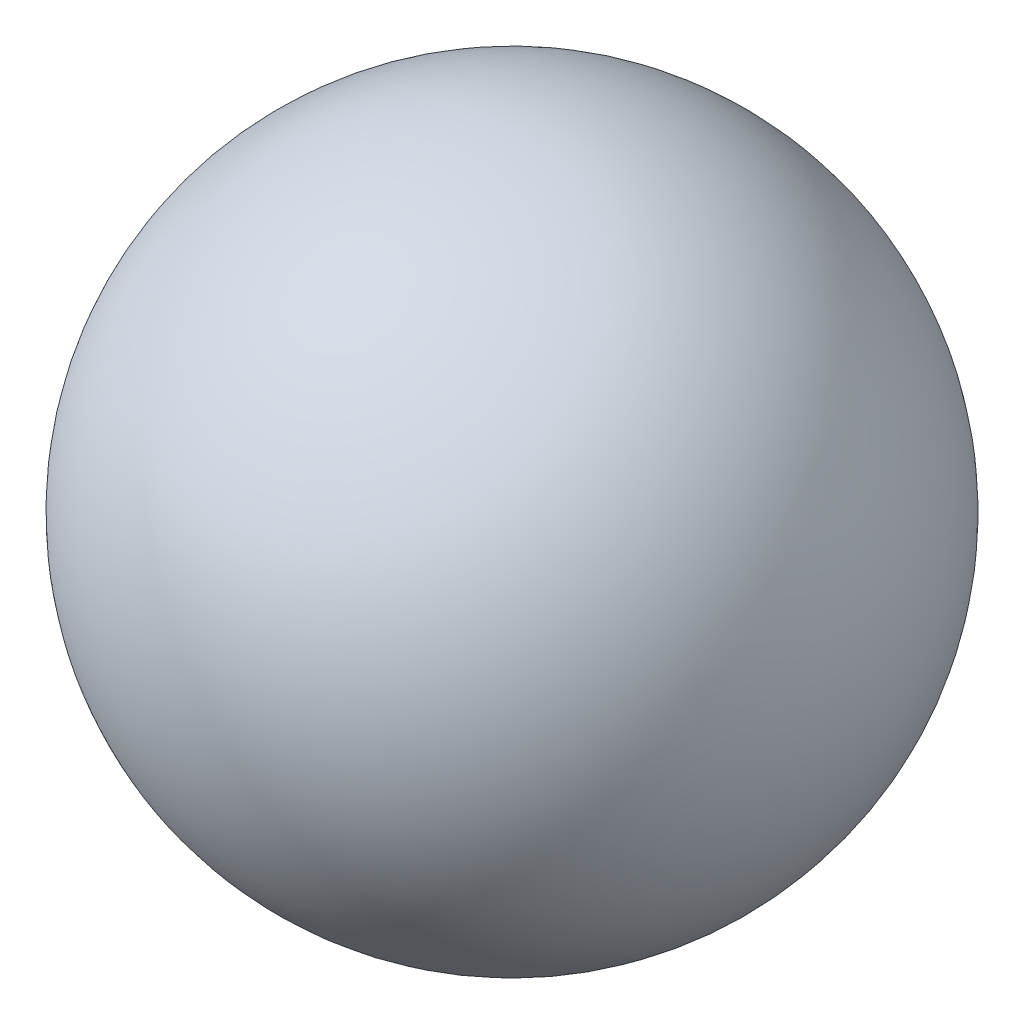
ISO-10303-21;
HEADER;
FILE_DESCRIPTION(('STEP AP214'),'2;1');
FILE_NAME('part.step','',(''),(''),'','','');
FILE_SCHEMA(('AUTOMOTIVE_DESIGN { 1 0 10303 214 1 1 1 1 }'));
ENDSEC;
DATA;
#1=APPLICATION_CONTEXT('core data for automotive mechanical design processes');
#2=APPLICATION_PROTOCOL_DEFINITION('international standard','automotive_design',2000,#1);
#3=PRODUCT_CONTEXT('',#1,'mechanical');
#4=PRODUCT('Part','Part','',(#3));
#5=PRODUCT_RELATED_PRODUCT_CATEGORY('part','',(#4));
#6=PRODUCT_DEFINITION_FORMATION('','',#4);
#7=PRODUCT_DEFINITION_CONTEXT('part definition',#1,'design');
#8=PRODUCT_DEFINITION('design','',#6,#7);
#9=PRODUCT_DEFINITION_SHAPE('','',#8);
#10=(LENGTH_UNIT() NAMED_UNIT(*) SI_UNIT(.MILLI.,.METRE.));
#11=(NAMED_UNIT(*) PLANE_ANGLE_UNIT() SI_UNIT($,.RADIAN.));
#12=(NAMED_UNIT(*) SI_UNIT($,.STERADIAN.) SOLID_ANGLE_UNIT());
#13=UNCERTAINTY_MEASURE_WITH_UNIT(LENGTH_MEASURE(1.E-05),#10,'distance_accuracy_value','');
#14=(GEOMETRIC_REPRESENTATION_CONTEXT(3) GLOBAL_UNCERTAINTY_ASSIGNED_CONTEXT((#13)) GLOBAL_UNIT_ASSIGNED_CONTEXT((#10,
#11,#12)) REPRESENTATION_CONTEXT('',''));
#15=CARTESIAN_POINT('',(0.,0.,0.));
#16=DIRECTION('',(0.,0.,1.));
#17=DIRECTION('',(1.,0.,0.));
#18=AXIS2_PLACEMENT_3D('',#15,#16,#17);
#19=CARTESIAN_POINT('',(0.,0.,8.));
#20=DIRECTION('',(0.,0.,1.));
#21=DIRECTION('',(-1.,0.,0.));
#22=AXIS2_PLACEMENT_3D('',#19,#20,#21);
#23=SPHERICAL_SURFACE('',#22,10.);
#24=CARTESIAN_POINT('',(-9.58979308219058E-08,0.,18.));
#25=VERTEX_POINT('',#24);
#26=VERTEX_LOOP('',#25);
#27=FACE_BOUND('',#26,.T.);
#28=CARTESIAN_POINT('',(0.,0.,0.));
#29=DIRECTION('',(0.,0.,1.));
#30=DIRECTION('',(0.,-1.,0.));
#31=AXIS2_PLACEMENT_3D('',#28,#29,#30);
#32=CIRCLE('',#31,6.);
#33=CARTESIAN_POINT('',(0.,-6.,0.));
#34=VERTEX_POINT('',#33);
#35=EDGE_CURVE('E30',#34,#34,#32,.T.);
#36=ORIENTED_EDGE('',*,*,#35,.T.);
#37=EDGE_LOOP('',(#36));
#38=FACE_BOUND('',#37,.T.);
#39=ADVANCED_FACE('F14',(#27,#38),#23,.T.);
#40=CARTESIAN_POINT('',(-6.072,6.092893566,0.));
#41=DIRECTION('',(0.,0.,1.));
#42=DIRECTION('',(0.,-1.,0.));
#43=AXIS2_PLACEMENT_3D('',#40,#41,#42);
#44=PLANE('',#43);
#45=CARTESIAN_POINT('',(0.,0.,0.));
#46=DIRECTION('',(0.,0.,1.));
#47=DIRECTION('',(0.,-1.,0.));
#48=AXIS2_PLACEMENT_3D('',#45,#46,#47);
#49=CIRCLE('',#48,2.5);
#50=CARTESIAN_POINT('',(0.,-2.5,0.));
#51=VERTEX_POINT('',#50);
#52=EDGE_CURVE('E21',#51,#51,#49,.T.);
#53=ORIENTED_EDGE('',*,*,#52,.T.);
#54=EDGE_LOOP('',(#53));
#55=FACE_BOUND('',#54,.T.);
#56=ORIENTED_EDGE('',*,*,#35,.F.);
#57=EDGE_LOOP('',(#56));
#58=FACE_BOUND('',#57,.T.);
#59=ADVANCED_FACE('F16',(#55,#58),#44,.F.);
#60=CARTESIAN_POINT('',(0.,0.,0.));
#61=DIRECTION('',(0.,0.,1.));
#62=DIRECTION('',(0.,-1.,0.));
#63=AXIS2_PLACEMENT_3D('',#60,#61,#62);
#64=CYLINDRICAL_SURFACE('',#63,2.5);
#65=CARTESIAN_POINT('',(0.,0.,9.1));
#66=DIRECTION('',(0.,0.,-1.));
#67=DIRECTION('',(-1.,0.,0.));
#68=AXIS2_PLACEMENT_3D('',#65,#66,#67);
#69=CIRCLE('',#68,2.5);
#70=CARTESIAN_POINT('',(-2.5,0.,9.1));
#71=VERTEX_POINT('',#70);
#72=EDGE_CURVE('E9',#71,#71,#69,.T.);
#73=ORIENTED_EDGE('',*,*,#72,.F.);
#74=EDGE_LOOP('',(#73));
#75=FACE_BOUND('',#74,.T.);
#76=ORIENTED_EDGE('',*,*,#52,.F.);
#77=EDGE_LOOP('',(#76));
#78=FACE_BOUND('',#77,.T.);
#79=ADVANCED_FACE('F37',(#75,#78),#64,.F.);
#80=CARTESIAN_POINT('',(0.,0.,9.1));
#81=DIRECTION('',(0.,0.,-1.));
#82=DIRECTION('',(-1.,0.,0.));
#83=AXIS2_PLACEMENT_3D('',#80,#81,#82);
#84=PLANE('',#83);
#85=ORIENTED_EDGE('',*,*,#72,.T.);
#86=EDGE_LOOP('',(#85));
#87=FACE_BOUND('',#86,.T.);
#88=ADVANCED_FACE('F27',(#87),#84,.T.);
#89=CLOSED_SHELL('',(#39,#59,#79,#88));
#90=MANIFOLD_SOLID_BREP('B1',#89);
#91=ADVANCED_BREP_SHAPE_REPRESENTATION('',(#18,#90),#14);
#92=SHAPE_DEFINITION_REPRESENTATION(#9,#91);
ENDSEC;
END-ISO-10303-21;
